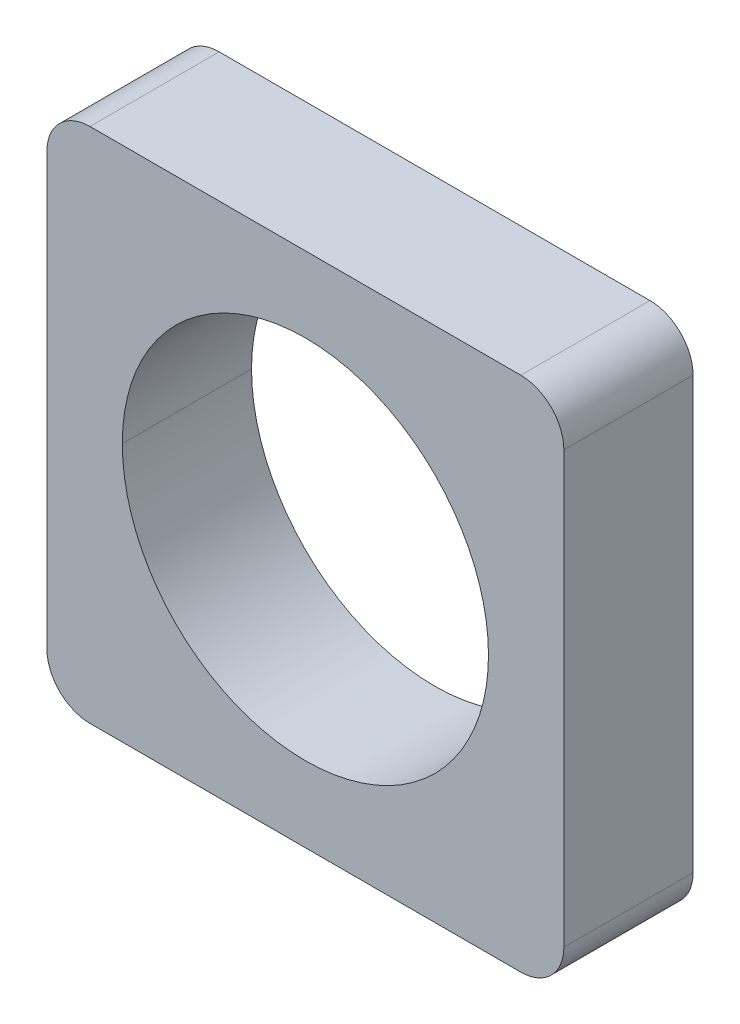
ISO-10303-21;
HEADER;
FILE_DESCRIPTION(('STEP AP214'),'2;1');
FILE_NAME('part.step','',(''),(''),'','','');
FILE_SCHEMA(('AUTOMOTIVE_DESIGN { 1 0 10303 214 1 1 1 1 }'));
ENDSEC;
DATA;
#1=APPLICATION_CONTEXT('core data for automotive mechanical design processes');
#2=APPLICATION_PROTOCOL_DEFINITION('international standard','automotive_design',2000,#1);
#3=PRODUCT_CONTEXT('',#1,'mechanical');
#4=PRODUCT('Part','Part','',(#3));
#5=PRODUCT_RELATED_PRODUCT_CATEGORY('part','',(#4));
#6=PRODUCT_DEFINITION_FORMATION('','',#4);
#7=PRODUCT_DEFINITION_CONTEXT('part definition',#1,'design');
#8=PRODUCT_DEFINITION('design','',#6,#7);
#9=PRODUCT_DEFINITION_SHAPE('','',#8);
#10=(LENGTH_UNIT() NAMED_UNIT(*) SI_UNIT(.MILLI.,.METRE.));
#11=(NAMED_UNIT(*) PLANE_ANGLE_UNIT() SI_UNIT($,.RADIAN.));
#12=(NAMED_UNIT(*) SI_UNIT($,.STERADIAN.) SOLID_ANGLE_UNIT());
#13=UNCERTAINTY_MEASURE_WITH_UNIT(LENGTH_MEASURE(1.E-05),#10,'distance_accuracy_value','');
#14=(GEOMETRIC_REPRESENTATION_CONTEXT(3) GLOBAL_UNCERTAINTY_ASSIGNED_CONTEXT((#13)) GLOBAL_UNIT_ASSIGNED_CONTEXT((#10,
#11,#12)) REPRESENTATION_CONTEXT('',''));
#15=CARTESIAN_POINT('',(0.,0.,0.));
#16=DIRECTION('',(0.,0.,1.));
#17=DIRECTION('',(1.,0.,0.));
#18=AXIS2_PLACEMENT_3D('',#15,#16,#17);
#19=CARTESIAN_POINT('',(-5.,-5.,9.2144));
#20=DIRECTION('',(0.,0.,-1.));
#21=DIRECTION('',(-1.,0.,0.));
#22=AXIS2_PLACEMENT_3D('',#19,#20,#21);
#23=CYLINDRICAL_SURFACE('',#22,1.);
#24=DIRECTION('',(0.,0.,1.));
#25=VECTOR('',#24,1.);
#26=CARTESIAN_POINT('',(-6.,-5.,0.));
#27=LINE('',#26,#25);
#28=CARTESIAN_POINT('',(-6.,-5.,0.));
#29=VERTEX_POINT('',#28);
#30=CARTESIAN_POINT('',(-6.,-5.,3.));
#31=VERTEX_POINT('',#30);
#32=EDGE_CURVE('E212',#29,#31,#27,.T.);
#33=ORIENTED_EDGE('',*,*,#32,.F.);
#34=CARTESIAN_POINT('',(-5.,-5.,0.));
#35=DIRECTION('',(0.,0.,1.));
#36=DIRECTION('',(-1.,0.,0.));
#37=AXIS2_PLACEMENT_3D('',#34,#35,#36);
#38=CIRCLE('',#37,1.);
#39=CARTESIAN_POINT('',(-5.,-6.,0.));
#40=VERTEX_POINT('',#39);
#41=EDGE_CURVE('E178',#29,#40,#38,.T.);
#42=ORIENTED_EDGE('',*,*,#41,.T.);
#43=DIRECTION('',(0.,0.,-1.));
#44=VECTOR('',#43,1.);
#45=CARTESIAN_POINT('',(-5.,-6.,0.));
#46=LINE('',#45,#44);
#47=CARTESIAN_POINT('',(-5.,-6.,3.));
#48=VERTEX_POINT('',#47);
#49=EDGE_CURVE('E219',#48,#40,#46,.T.);
#50=ORIENTED_EDGE('',*,*,#49,.F.);
#51=CARTESIAN_POINT('',(-5.,-5.,3.));
#52=DIRECTION('',(0.,0.,1.));
#53=DIRECTION('',(-1.,0.,0.));
#54=AXIS2_PLACEMENT_3D('',#51,#52,#53);
#55=CIRCLE('',#54,1.);
#56=EDGE_CURVE('E51',#31,#48,#55,.T.);
#57=ORIENTED_EDGE('',*,*,#56,.F.);
#58=EDGE_LOOP('',(#33,#42,#50,#57));
#59=FACE_BOUND('',#58,.T.);
#60=ADVANCED_FACE('F17',(#59),#23,.T.);
#61=CARTESIAN_POINT('',(5.,-5.,9.2144));
#62=DIRECTION('',(0.,0.,-1.));
#63=DIRECTION('',(-1.,0.,0.));
#64=AXIS2_PLACEMENT_3D('',#61,#62,#63);
#65=CYLINDRICAL_SURFACE('',#64,1.);
#66=DIRECTION('',(0.,0.,1.));
#67=VECTOR('',#66,1.);
#68=CARTESIAN_POINT('',(5.,-6.,0.));
#69=LINE('',#68,#67);
#70=CARTESIAN_POINT('',(5.,-6.,0.));
#71=VERTEX_POINT('',#70);
#72=CARTESIAN_POINT('',(5.,-6.,3.));
#73=VERTEX_POINT('',#72);
#74=EDGE_CURVE('E221',#71,#73,#69,.T.);
#75=ORIENTED_EDGE('',*,*,#74,.F.);
#76=CARTESIAN_POINT('',(5.,-5.,0.));
#77=DIRECTION('',(0.,0.,1.));
#78=DIRECTION('',(-1.,0.,0.));
#79=AXIS2_PLACEMENT_3D('',#76,#77,#78);
#80=CIRCLE('',#79,1.);
#81=CARTESIAN_POINT('',(6.,-5.,0.));
#82=VERTEX_POINT('',#81);
#83=EDGE_CURVE('E164',#71,#82,#80,.T.);
#84=ORIENTED_EDGE('',*,*,#83,.T.);
#85=DIRECTION('',(0.,0.,-1.));
#86=VECTOR('',#85,1.);
#87=CARTESIAN_POINT('',(6.,-5.,0.));
#88=LINE('',#87,#86);
#89=CARTESIAN_POINT('',(6.,-5.,3.));
#90=VERTEX_POINT('',#89);
#91=EDGE_CURVE('E209',#90,#82,#88,.T.);
#92=ORIENTED_EDGE('',*,*,#91,.F.);
#93=CARTESIAN_POINT('',(5.,-5.,3.));
#94=DIRECTION('',(0.,0.,1.));
#95=DIRECTION('',(-1.,0.,0.));
#96=AXIS2_PLACEMENT_3D('',#93,#94,#95);
#97=CIRCLE('',#96,1.);
#98=EDGE_CURVE('E21',#73,#90,#97,.T.);
#99=ORIENTED_EDGE('',*,*,#98,.F.);
#100=EDGE_LOOP('',(#75,#84,#92,#99));
#101=FACE_BOUND('',#100,.T.);
#102=ADVANCED_FACE('F19',(#101),#65,.T.);
#103=CARTESIAN_POINT('',(5.,5.,9.2144));
#104=DIRECTION('',(0.,0.,-1.));
#105=DIRECTION('',(-1.,0.,0.));
#106=AXIS2_PLACEMENT_3D('',#103,#104,#105);
#107=CYLINDRICAL_SURFACE('',#106,1.);
#108=DIRECTION('',(0.,0.,1.));
#109=VECTOR('',#108,1.);
#110=CARTESIAN_POINT('',(6.,5.,0.));
#111=LINE('',#110,#109);
#112=CARTESIAN_POINT('',(6.,5.,0.));
#113=VERTEX_POINT('',#112);
#114=CARTESIAN_POINT('',(6.,5.,3.));
#115=VERTEX_POINT('',#114);
#116=EDGE_CURVE('E201',#113,#115,#111,.T.);
#117=ORIENTED_EDGE('',*,*,#116,.F.);
#118=CARTESIAN_POINT('',(5.,5.,0.));
#119=DIRECTION('',(0.,0.,1.));
#120=DIRECTION('',(-1.,0.,0.));
#121=AXIS2_PLACEMENT_3D('',#118,#119,#120);
#122=CIRCLE('',#121,1.);
#123=CARTESIAN_POINT('',(5.,6.,0.));
#124=VERTEX_POINT('',#123);
#125=EDGE_CURVE('E145',#113,#124,#122,.T.);
#126=ORIENTED_EDGE('',*,*,#125,.T.);
#127=DIRECTION('',(0.,0.,-1.));
#128=VECTOR('',#127,1.);
#129=CARTESIAN_POINT('',(5.,6.,0.));
#130=LINE('',#129,#128);
#131=CARTESIAN_POINT('',(5.,6.,3.));
#132=VERTEX_POINT('',#131);
#133=EDGE_CURVE('E193',#132,#124,#130,.T.);
#134=ORIENTED_EDGE('',*,*,#133,.F.);
#135=CARTESIAN_POINT('',(5.,5.,3.));
#136=DIRECTION('',(0.,0.,1.));
#137=DIRECTION('',(-1.,0.,0.));
#138=AXIS2_PLACEMENT_3D('',#135,#136,#137);
#139=CIRCLE('',#138,1.);
#140=EDGE_CURVE('E11',#115,#132,#139,.T.);
#141=ORIENTED_EDGE('',*,*,#140,.F.);
#142=EDGE_LOOP('',(#117,#126,#134,#141));
#143=FACE_BOUND('',#142,.T.);
#144=ADVANCED_FACE('F349',(#143),#107,.T.);
#145=CARTESIAN_POINT('',(-5.,5.,9.2144));
#146=DIRECTION('',(0.,0.,-1.));
#147=DIRECTION('',(-1.,0.,0.));
#148=AXIS2_PLACEMENT_3D('',#145,#146,#147);
#149=CYLINDRICAL_SURFACE('',#148,1.);
#150=DIRECTION('',(0.,0.,1.));
#151=VECTOR('',#150,1.);
#152=CARTESIAN_POINT('',(-5.,6.,0.));
#153=LINE('',#152,#151);
#154=CARTESIAN_POINT('',(-5.,6.,0.));
#155=VERTEX_POINT('',#154);
#156=CARTESIAN_POINT('',(-5.,6.,3.));
#157=VERTEX_POINT('',#156);
#158=EDGE_CURVE('E158',#155,#157,#153,.T.);
#159=ORIENTED_EDGE('',*,*,#158,.F.);
#160=CARTESIAN_POINT('',(-5.,5.,0.));
#161=DIRECTION('',(0.,0.,1.));
#162=DIRECTION('',(-1.,0.,0.));
#163=AXIS2_PLACEMENT_3D('',#160,#161,#162);
#164=CIRCLE('',#163,1.);
#165=CARTESIAN_POINT('',(-6.,5.,0.));
#166=VERTEX_POINT('',#165);
#167=EDGE_CURVE('E163',#155,#166,#164,.T.);
#168=ORIENTED_EDGE('',*,*,#167,.T.);
#169=DIRECTION('',(0.,0.,-1.));
#170=VECTOR('',#169,1.);
#171=CARTESIAN_POINT('',(-6.,5.,0.));
#172=LINE('',#171,#170);
#173=CARTESIAN_POINT('',(-6.,5.,3.));
#174=VERTEX_POINT('',#173);
#175=EDGE_CURVE('E230',#174,#166,#172,.T.);
#176=ORIENTED_EDGE('',*,*,#175,.F.);
#177=CARTESIAN_POINT('',(-5.,5.,3.));
#178=DIRECTION('',(0.,0.,1.));
#179=DIRECTION('',(-1.,0.,0.));
#180=AXIS2_PLACEMENT_3D('',#177,#178,#179);
#181=CIRCLE('',#180,1.);
#182=EDGE_CURVE('E40',#157,#174,#181,.T.);
#183=ORIENTED_EDGE('',*,*,#182,.F.);
#184=EDGE_LOOP('',(#159,#168,#176,#183));
#185=FACE_BOUND('',#184,.T.);
#186=ADVANCED_FACE('F345',(#185),#149,.T.);
#187=CARTESIAN_POINT('',(0.,0.,3.));
#188=DIRECTION('',(0.,0.,1.));
#189=DIRECTION('',(1.,0.,0.));
#190=AXIS2_PLACEMENT_3D('',#187,#188,#189);
#191=PLANE('',#190);
#192=CARTESIAN_POINT('',(0.,0.,3.));
#193=DIRECTION('',(0.,0.,-1.));
#194=DIRECTION('',(1.,0.,0.));
#195=AXIS2_PLACEMENT_3D('',#192,#193,#194);
#196=CIRCLE('',#195,4.25);
#197=CARTESIAN_POINT('',(4.25,0.,3.));
#198=VERTEX_POINT('',#197);
#199=CARTESIAN_POINT('',(-4.25,0.,3.));
#200=VERTEX_POINT('',#199);
#201=EDGE_CURVE('E143',#198,#200,#196,.T.);
#202=ORIENTED_EDGE('',*,*,#201,.T.);
#203=CARTESIAN_POINT('',(0.,0.,3.));
#204=DIRECTION('',(0.,0.,-1.));
#205=DIRECTION('',(1.,0.,0.));
#206=AXIS2_PLACEMENT_3D('',#203,#204,#205);
#207=CIRCLE('',#206,4.25);
#208=EDGE_CURVE('E136',#200,#198,#207,.T.);
#209=ORIENTED_EDGE('',*,*,#208,.T.);
#210=EDGE_LOOP('',(#202,#209));
#211=FACE_BOUND('',#210,.T.);
#212=DIRECTION('',(1.,0.,0.));
#213=VECTOR('',#212,1.);
#214=CARTESIAN_POINT('',(6.,6.,3.));
#215=LINE('',#214,#213);
#216=EDGE_CURVE('E189',#157,#132,#215,.T.);
#217=ORIENTED_EDGE('',*,*,#216,.F.);
#218=ORIENTED_EDGE('',*,*,#182,.T.);
#219=DIRECTION('',(0.,1.,0.));
#220=VECTOR('',#219,1.);
#221=CARTESIAN_POINT('',(-6.,6.,3.));
#222=LINE('',#221,#220);
#223=EDGE_CURVE('E226',#31,#174,#222,.T.);
#224=ORIENTED_EDGE('',*,*,#223,.F.);
#225=ORIENTED_EDGE('',*,*,#56,.T.);
#226=DIRECTION('',(-1.,0.,0.));
#227=VECTOR('',#226,1.);
#228=CARTESIAN_POINT('',(-6.,-6.,3.));
#229=LINE('',#228,#227);
#230=EDGE_CURVE('E215',#73,#48,#229,.T.);
#231=ORIENTED_EDGE('',*,*,#230,.F.);
#232=ORIENTED_EDGE('',*,*,#98,.T.);
#233=DIRECTION('',(0.,-1.,0.));
#234=VECTOR('',#233,1.);
#235=CARTESIAN_POINT('',(6.,-6.,3.));
#236=LINE('',#235,#234);
#237=EDGE_CURVE('E205',#115,#90,#236,.T.);
#238=ORIENTED_EDGE('',*,*,#237,.F.);
#239=ORIENTED_EDGE('',*,*,#140,.T.);
#240=EDGE_LOOP('',(#217,#218,#224,#225,#231,#232,#238,#239));
#241=FACE_BOUND('',#240,.T.);
#242=ADVANCED_FACE('F239',(#211,#241),#191,.T.);
#243=CARTESIAN_POINT('',(-6.,6.,0.));
#244=DIRECTION('',(-1.,0.,0.));
#245=DIRECTION('',(0.,0.,1.));
#246=AXIS2_PLACEMENT_3D('',#243,#244,#245);
#247=PLANE('',#246);
#248=ORIENTED_EDGE('',*,*,#223,.T.);
#249=ORIENTED_EDGE('',*,*,#175,.T.);
#250=DIRECTION('',(0.,-1.,0.));
#251=VECTOR('',#250,1.);
#252=CARTESIAN_POINT('',(-6.,0.,0.));
#253=LINE('',#252,#251);
#254=EDGE_CURVE('E185',#166,#29,#253,.T.);
#255=ORIENTED_EDGE('',*,*,#254,.T.);
#256=ORIENTED_EDGE('',*,*,#32,.T.);
#257=EDGE_LOOP('',(#248,#249,#255,#256));
#258=FACE_BOUND('',#257,.T.);
#259=ADVANCED_FACE('F236',(#258),#247,.T.);
#260=CARTESIAN_POINT('',(-6.,-6.,0.));
#261=DIRECTION('',(0.,-1.,0.));
#262=DIRECTION('',(0.,0.,-1.));
#263=AXIS2_PLACEMENT_3D('',#260,#261,#262);
#264=PLANE('',#263);
#265=ORIENTED_EDGE('',*,*,#230,.T.);
#266=ORIENTED_EDGE('',*,*,#49,.T.);
#267=DIRECTION('',(1.,0.,0.));
#268=VECTOR('',#267,1.);
#269=CARTESIAN_POINT('',(0.,-6.,0.));
#270=LINE('',#269,#268);
#271=EDGE_CURVE('E168',#40,#71,#270,.T.);
#272=ORIENTED_EDGE('',*,*,#271,.T.);
#273=ORIENTED_EDGE('',*,*,#74,.T.);
#274=EDGE_LOOP('',(#265,#266,#272,#273));
#275=FACE_BOUND('',#274,.T.);
#276=ADVANCED_FACE('F243',(#275),#264,.T.);
#277=CARTESIAN_POINT('',(6.,-6.,0.));
#278=DIRECTION('',(1.,0.,0.));
#279=DIRECTION('',(0.,1.,0.));
#280=AXIS2_PLACEMENT_3D('',#277,#278,#279);
#281=PLANE('',#280);
#282=DIRECTION('',(0.,1.,0.));
#283=VECTOR('',#282,1.);
#284=CARTESIAN_POINT('',(6.,0.,0.));
#285=LINE('',#284,#283);
#286=EDGE_CURVE('E169',#82,#113,#285,.T.);
#287=ORIENTED_EDGE('',*,*,#286,.T.);
#288=ORIENTED_EDGE('',*,*,#116,.T.);
#289=ORIENTED_EDGE('',*,*,#237,.T.);
#290=ORIENTED_EDGE('',*,*,#91,.T.);
#291=EDGE_LOOP('',(#287,#288,#289,#290));
#292=FACE_BOUND('',#291,.T.);
#293=ADVANCED_FACE('F358',(#292),#281,.T.);
#294=CARTESIAN_POINT('',(6.,6.,0.));
#295=DIRECTION('',(0.,1.,0.));
#296=DIRECTION('',(1.,0.,0.));
#297=AXIS2_PLACEMENT_3D('',#294,#295,#296);
#298=PLANE('',#297);
#299=DIRECTION('',(-1.,0.,0.));
#300=VECTOR('',#299,1.);
#301=CARTESIAN_POINT('',(0.,6.,0.));
#302=LINE('',#301,#300);
#303=EDGE_CURVE('E137',#124,#155,#302,.T.);
#304=ORIENTED_EDGE('',*,*,#303,.T.);
#305=ORIENTED_EDGE('',*,*,#158,.T.);
#306=ORIENTED_EDGE('',*,*,#216,.T.);
#307=ORIENTED_EDGE('',*,*,#133,.T.);
#308=EDGE_LOOP('',(#304,#305,#306,#307));
#309=FACE_BOUND('',#308,.T.);
#310=ADVANCED_FACE('F340',(#309),#298,.T.);
#311=CARTESIAN_POINT('',(0.,0.,0.));
#312=DIRECTION('',(0.,0.,1.));
#313=DIRECTION('',(1.,0.,0.));
#314=AXIS2_PLACEMENT_3D('',#311,#312,#313);
#315=CYLINDRICAL_SURFACE('',#314,4.25);
#316=DIRECTION('',(0.,0.,1.));
#317=VECTOR('',#316,1.);
#318=CARTESIAN_POINT('',(-4.25,0.,0.));
#319=LINE('',#318,#317);
#320=CARTESIAN_POINT('',(-4.25,0.,0.));
#321=VERTEX_POINT('',#320);
#322=EDGE_CURVE('E131',#321,#200,#319,.T.);
#323=ORIENTED_EDGE('',*,*,#322,.F.);
#324=CARTESIAN_POINT('',(0.,0.,0.));
#325=DIRECTION('',(0.,0.,-1.));
#326=DIRECTION('',(1.,0.,0.));
#327=AXIS2_PLACEMENT_3D('',#324,#325,#326);
#328=CIRCLE('',#327,4.25);
#329=CARTESIAN_POINT('',(4.25,0.,0.));
#330=VERTEX_POINT('',#329);
#331=EDGE_CURVE('E125',#321,#330,#328,.T.);
#332=ORIENTED_EDGE('',*,*,#331,.T.);
#333=DIRECTION('',(0.,0.,1.));
#334=VECTOR('',#333,1.);
#335=CARTESIAN_POINT('',(4.25,0.,0.));
#336=LINE('',#335,#334);
#337=EDGE_CURVE('E128',#330,#198,#336,.T.);
#338=ORIENTED_EDGE('',*,*,#337,.T.);
#339=ORIENTED_EDGE('',*,*,#208,.F.);
#340=EDGE_LOOP('',(#323,#332,#338,#339));
#341=FACE_BOUND('',#340,.T.);
#342=ADVANCED_FACE('F127',(#341),#315,.F.);
#343=CARTESIAN_POINT('',(0.,0.,0.));
#344=DIRECTION('',(0.,0.,1.));
#345=DIRECTION('',(1.,0.,0.));
#346=AXIS2_PLACEMENT_3D('',#343,#344,#345);
#347=PLANE('',#346);
#348=CARTESIAN_POINT('',(0.,0.,0.));
#349=DIRECTION('',(0.,0.,-1.));
#350=DIRECTION('',(1.,0.,0.));
#351=AXIS2_PLACEMENT_3D('',#348,#349,#350);
#352=CIRCLE('',#351,4.25);
#353=EDGE_CURVE('E141',#330,#321,#352,.T.);
#354=ORIENTED_EDGE('',*,*,#353,.F.);
#355=ORIENTED_EDGE('',*,*,#331,.F.);
#356=EDGE_LOOP('',(#354,#355));
#357=FACE_BOUND('',#356,.T.);
#358=ORIENTED_EDGE('',*,*,#125,.F.);
#359=ORIENTED_EDGE('',*,*,#286,.F.);
#360=ORIENTED_EDGE('',*,*,#83,.F.);
#361=ORIENTED_EDGE('',*,*,#271,.F.);
#362=ORIENTED_EDGE('',*,*,#41,.F.);
#363=ORIENTED_EDGE('',*,*,#254,.F.);
#364=ORIENTED_EDGE('',*,*,#167,.F.);
#365=ORIENTED_EDGE('',*,*,#303,.F.);
#366=EDGE_LOOP('',(#358,#359,#360,#361,#362,#363,#364,#365));
#367=FACE_BOUND('',#366,.T.);
#368=ADVANCED_FACE('F147',(#357,#367),#347,.F.);
#369=CARTESIAN_POINT('',(0.,0.,0.));
#370=DIRECTION('',(0.,0.,1.));
#371=DIRECTION('',(1.,0.,0.));
#372=AXIS2_PLACEMENT_3D('',#369,#370,#371);
#373=CYLINDRICAL_SURFACE('',#372,4.25);
#374=ORIENTED_EDGE('',*,*,#353,.T.);
#375=ORIENTED_EDGE('',*,*,#322,.T.);
#376=ORIENTED_EDGE('',*,*,#201,.F.);
#377=ORIENTED_EDGE('',*,*,#337,.F.);
#378=EDGE_LOOP('',(#374,#375,#376,#377));
#379=FACE_BOUND('',#378,.T.);
#380=ADVANCED_FACE('F140',(#379),#373,.F.);
#381=CLOSED_SHELL('',(#60,#102,#144,#186,#242,#259,#276,#293,#310,#342,#368,#380));
#382=MANIFOLD_SOLID_BREP('B1',#381);
#383=ADVANCED_BREP_SHAPE_REPRESENTATION('',(#18,#382),#14);
#384=SHAPE_DEFINITION_REPRESENTATION(#9,#383);
ENDSEC;
END-ISO-10303-21;
